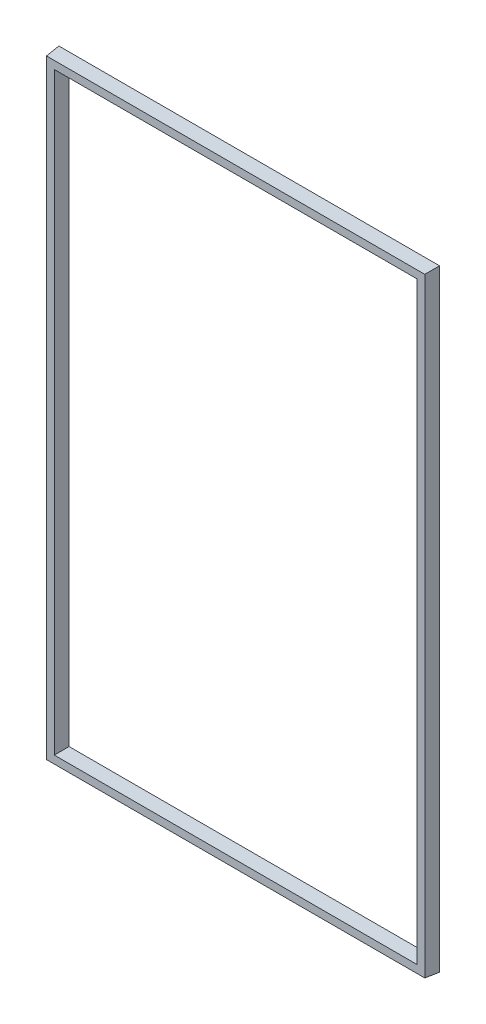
ISO-10303-21;
HEADER;
FILE_DESCRIPTION(('STEP AP214'),'2;1');
FILE_NAME('part.step','',(''),(''),'','','');
FILE_SCHEMA(('AUTOMOTIVE_DESIGN { 1 0 10303 214 1 1 1 1 }'));
ENDSEC;
DATA;
#1=APPLICATION_CONTEXT('core data for automotive mechanical design processes');
#2=APPLICATION_PROTOCOL_DEFINITION('international standard','automotive_design',2000,#1);
#3=PRODUCT_CONTEXT('',#1,'mechanical');
#4=PRODUCT('Part','Part','',(#3));
#5=PRODUCT_RELATED_PRODUCT_CATEGORY('part','',(#4));
#6=PRODUCT_DEFINITION_FORMATION('','',#4);
#7=PRODUCT_DEFINITION_CONTEXT('part definition',#1,'design');
#8=PRODUCT_DEFINITION('design','',#6,#7);
#9=PRODUCT_DEFINITION_SHAPE('','',#8);
#10=(LENGTH_UNIT() NAMED_UNIT(*) SI_UNIT(.MILLI.,.METRE.));
#11=(NAMED_UNIT(*) PLANE_ANGLE_UNIT() SI_UNIT($,.RADIAN.));
#12=(NAMED_UNIT(*) SI_UNIT($,.STERADIAN.) SOLID_ANGLE_UNIT());
#13=UNCERTAINTY_MEASURE_WITH_UNIT(LENGTH_MEASURE(1.E-05),#10,'distance_accuracy_value','');
#14=(GEOMETRIC_REPRESENTATION_CONTEXT(3) GLOBAL_UNCERTAINTY_ASSIGNED_CONTEXT((#13)) GLOBAL_UNIT_ASSIGNED_CONTEXT((#10,
#11,#12)) REPRESENTATION_CONTEXT('',''));
#15=CARTESIAN_POINT('',(0.,0.,0.));
#16=DIRECTION('',(0.,0.,1.));
#17=DIRECTION('',(1.,0.,0.));
#18=AXIS2_PLACEMENT_3D('',#15,#16,#17);
#19=CARTESIAN_POINT('',(0.,0.,2.));
#20=DIRECTION('',(0.,0.,1.));
#21=DIRECTION('',(1.,0.,0.));
#22=AXIS2_PLACEMENT_3D('',#19,#20,#21);
#23=PLANE('',#22);
#24=DIRECTION('',(-1.,0.,0.));
#25=VECTOR('',#24,1.);
#26=CARTESIAN_POINT('',(-63.,-97.3250226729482,2.));
#27=LINE('',#26,#25);
#28=CARTESIAN_POINT('',(-62.8250226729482,-97.3250226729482,2.));
#29=VERTEX_POINT('',#28);
#30=CARTESIAN_POINT('',(-7.17497732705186,-97.3250226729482,2.));
#31=VERTEX_POINT('',#30);
#32=EDGE_CURVE('E136',#29,#31,#27,.F.);
#33=ORIENTED_EDGE('',*,*,#32,.T.);
#34=DIRECTION('',(0.,-1.,0.));
#35=VECTOR('',#34,1.);
#36=CARTESIAN_POINT('',(-7.17497732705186,-12.,2.));
#37=LINE('',#36,#35);
#38=CARTESIAN_POINT('',(-7.17497732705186,-7.67497732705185,2.));
#39=VERTEX_POINT('',#38);
#40=EDGE_CURVE('E156',#31,#39,#37,.F.);
#41=ORIENTED_EDGE('',*,*,#40,.T.);
#42=DIRECTION('',(1.,0.,0.));
#43=VECTOR('',#42,1.);
#44=CARTESIAN_POINT('',(-7.00000000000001,-7.67497732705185,2.));
#45=LINE('',#44,#43);
#46=CARTESIAN_POINT('',(-62.8250226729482,-7.67497732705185,2.));
#47=VERTEX_POINT('',#46);
#48=EDGE_CURVE('E139',#39,#47,#45,.F.);
#49=ORIENTED_EDGE('',*,*,#48,.T.);
#50=DIRECTION('',(0.,1.,0.));
#51=VECTOR('',#50,1.);
#52=CARTESIAN_POINT('',(-62.8250226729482,-93.,2.));
#53=LINE('',#52,#51);
#54=EDGE_CURVE('E132',#47,#29,#53,.F.);
#55=ORIENTED_EDGE('',*,*,#54,.T.);
#56=EDGE_LOOP('',(#33,#41,#49,#55));
#57=FACE_BOUND('',#56,.T.);
#58=DIRECTION('',(-1.,0.,0.));
#59=VECTOR('',#58,1.);
#60=CARTESIAN_POINT('',(-8.50000000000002,-8.82502267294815,2.));
#61=LINE('',#60,#59);
#62=CARTESIAN_POINT('',(-8.32502267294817,-8.82502267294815,2.));
#63=VERTEX_POINT('',#62);
#64=CARTESIAN_POINT('',(-61.6749773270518,-8.82502267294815,2.));
#65=VERTEX_POINT('',#64);
#66=EDGE_CURVE('E51',#63,#65,#61,.T.);
#67=ORIENTED_EDGE('',*,*,#66,.F.);
#68=DIRECTION('',(0.,1.,0.));
#69=VECTOR('',#68,1.);
#70=CARTESIAN_POINT('',(-8.32502267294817,-96.,2.));
#71=LINE('',#70,#69);
#72=CARTESIAN_POINT('',(-8.32502267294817,-96.1749773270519,2.));
#73=VERTEX_POINT('',#72);
#74=EDGE_CURVE('E97',#73,#63,#71,.T.);
#75=ORIENTED_EDGE('',*,*,#74,.F.);
#76=DIRECTION('',(1.,0.,0.));
#77=VECTOR('',#76,1.);
#78=CARTESIAN_POINT('',(-61.5,-96.1749773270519,2.));
#79=LINE('',#78,#77);
#80=CARTESIAN_POINT('',(-61.6749773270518,-96.1749773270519,2.));
#81=VERTEX_POINT('',#80);
#82=EDGE_CURVE('E172',#81,#73,#79,.T.);
#83=ORIENTED_EDGE('',*,*,#82,.F.);
#84=DIRECTION('',(0.,-1.,0.));
#85=VECTOR('',#84,1.);
#86=CARTESIAN_POINT('',(-61.6749773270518,-9.,2.));
#87=LINE('',#86,#85);
#88=EDGE_CURVE('E185',#65,#81,#87,.T.);
#89=ORIENTED_EDGE('',*,*,#88,.F.);
#90=EDGE_LOOP('',(#67,#75,#83,#89));
#91=FACE_BOUND('',#90,.T.);
#92=ADVANCED_FACE('F47',(#57,#91),#23,.T.);
#93=CARTESIAN_POINT('',(0.,0.,0.));
#94=DIRECTION('',(0.,0.,1.));
#95=DIRECTION('',(1.,0.,0.));
#96=AXIS2_PLACEMENT_3D('',#93,#94,#95);
#97=PLANE('',#96);
#98=DIRECTION('',(1.,0.,0.));
#99=VECTOR('',#98,1.);
#100=CARTESIAN_POINT('',(-63.,-97.5,0.));
#101=LINE('',#100,#99);
#102=CARTESIAN_POINT('',(-63.,-97.5,0.));
#103=VERTEX_POINT('',#102);
#104=CARTESIAN_POINT('',(-7.00000000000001,-97.5,0.));
#105=VERTEX_POINT('',#104);
#106=EDGE_CURVE('E176',#103,#105,#101,.T.);
#107=ORIENTED_EDGE('',*,*,#106,.F.);
#108=DIRECTION('',(0.,-1.,0.));
#109=VECTOR('',#108,1.);
#110=CARTESIAN_POINT('',(-63.,-93.,0.));
#111=LINE('',#110,#109);
#112=CARTESIAN_POINT('',(-63.,-7.5,0.));
#113=VERTEX_POINT('',#112);
#114=EDGE_CURVE('E148',#113,#103,#111,.T.);
#115=ORIENTED_EDGE('',*,*,#114,.F.);
#116=DIRECTION('',(-1.,0.,0.));
#117=VECTOR('',#116,1.);
#118=CARTESIAN_POINT('',(-7.00000000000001,-7.5,0.));
#119=LINE('',#118,#117);
#120=CARTESIAN_POINT('',(-7.00000000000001,-7.5,0.));
#121=VERTEX_POINT('',#120);
#122=EDGE_CURVE('E162',#121,#113,#119,.T.);
#123=ORIENTED_EDGE('',*,*,#122,.F.);
#124=DIRECTION('',(0.,1.,0.));
#125=VECTOR('',#124,1.);
#126=CARTESIAN_POINT('',(-7.00000000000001,-12.,0.));
#127=LINE('',#126,#125);
#128=EDGE_CURVE('E202',#105,#121,#127,.T.);
#129=ORIENTED_EDGE('',*,*,#128,.F.);
#130=EDGE_LOOP('',(#107,#115,#123,#129));
#131=FACE_BOUND('',#130,.T.);
#132=DIRECTION('',(0.,1.,0.));
#133=VECTOR('',#132,1.);
#134=CARTESIAN_POINT('',(-8.50000000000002,-96.,0.));
#135=LINE('',#134,#133);
#136=CARTESIAN_POINT('',(-8.50000000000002,-96.,0.));
#137=VERTEX_POINT('',#136);
#138=CARTESIAN_POINT('',(-8.50000000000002,-9.,0.));
#139=VERTEX_POINT('',#138);
#140=EDGE_CURVE('E216',#137,#139,#135,.T.);
#141=ORIENTED_EDGE('',*,*,#140,.T.);
#142=DIRECTION('',(-1.,0.,0.));
#143=VECTOR('',#142,1.);
#144=CARTESIAN_POINT('',(-8.50000000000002,-9.,0.));
#145=LINE('',#144,#143);
#146=CARTESIAN_POINT('',(-61.5,-9.,0.));
#147=VERTEX_POINT('',#146);
#148=EDGE_CURVE('E213',#139,#147,#145,.T.);
#149=ORIENTED_EDGE('',*,*,#148,.T.);
#150=DIRECTION('',(0.,-1.,0.));
#151=VECTOR('',#150,1.);
#152=CARTESIAN_POINT('',(-61.5,-9.,0.));
#153=LINE('',#152,#151);
#154=CARTESIAN_POINT('',(-61.5,-96.,0.));
#155=VERTEX_POINT('',#154);
#156=EDGE_CURVE('E209',#147,#155,#153,.T.);
#157=ORIENTED_EDGE('',*,*,#156,.T.);
#158=DIRECTION('',(1.,0.,0.));
#159=VECTOR('',#158,1.);
#160=CARTESIAN_POINT('',(-61.5,-96.,0.));
#161=LINE('',#160,#159);
#162=EDGE_CURVE('E183',#155,#137,#161,.T.);
#163=ORIENTED_EDGE('',*,*,#162,.T.);
#164=EDGE_LOOP('',(#141,#149,#157,#163));
#165=FACE_BOUND('',#164,.T.);
#166=ADVANCED_FACE('F220',(#131,#165),#97,.F.);
#167=CARTESIAN_POINT('',(-63.,-97.5,0.));
#168=DIRECTION('',(0.,-0.996194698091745,0.0871557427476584));
#169=DIRECTION('',(0.,-0.0871557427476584,-0.996194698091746));
#170=AXIS2_PLACEMENT_3D('',#167,#168,#169);
#171=PLANE('',#170);
#172=ORIENTED_EDGE('',*,*,#106,.T.);
#173=DIRECTION('',(0.0868265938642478,-0.0868265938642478,-0.992432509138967));
#174=VECTOR('',#173,1.);
#175=CARTESIAN_POINT('',(-7.64457230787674,-96.8554276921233,7.3674951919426));
#176=LINE('',#175,#174);
#177=EDGE_CURVE('E11',#31,#105,#176,.T.);
#178=ORIENTED_EDGE('',*,*,#177,.F.);
#179=ORIENTED_EDGE('',*,*,#32,.F.);
#180=DIRECTION('',(-0.0868265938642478,-0.0868265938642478,-0.992432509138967));
#181=VECTOR('',#180,1.);
#182=CARTESIAN_POINT('',(-63.,-97.5,0.));
#183=LINE('',#182,#181);
#184=EDGE_CURVE('E144',#29,#103,#183,.T.);
#185=ORIENTED_EDGE('',*,*,#184,.T.);
#186=EDGE_LOOP('',(#172,#178,#179,#185));
#187=FACE_BOUND('',#186,.T.);
#188=ADVANCED_FACE('F154',(#187),#171,.T.);
#189=CARTESIAN_POINT('',(-7.00000000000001,-12.,0.));
#190=DIRECTION('',(0.996194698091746,0.,0.0871557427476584));
#191=DIRECTION('',(0.0871557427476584,0.,-0.996194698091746));
#192=AXIS2_PLACEMENT_3D('',#189,#190,#191);
#193=PLANE('',#192);
#194=ORIENTED_EDGE('',*,*,#128,.T.);
#195=DIRECTION('',(0.0868265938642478,0.0868265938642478,-0.992432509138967));
#196=VECTOR('',#195,1.);
#197=CARTESIAN_POINT('',(-7.00000000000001,-7.5,0.));
#198=LINE('',#197,#196);
#199=EDGE_CURVE('E58',#39,#121,#198,.T.);
#200=ORIENTED_EDGE('',*,*,#199,.F.);
#201=ORIENTED_EDGE('',*,*,#40,.F.);
#202=ORIENTED_EDGE('',*,*,#177,.T.);
#203=EDGE_LOOP('',(#194,#200,#201,#202));
#204=FACE_BOUND('',#203,.T.);
#205=ADVANCED_FACE('F234',(#204),#193,.T.);
#206=CARTESIAN_POINT('',(-7.00000000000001,-7.5,0.));
#207=DIRECTION('',(0.,0.996194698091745,0.0871557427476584));
#208=DIRECTION('',(0.,-0.0871557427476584,0.996194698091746));
#209=AXIS2_PLACEMENT_3D('',#206,#207,#208);
#210=PLANE('',#209);
#211=ORIENTED_EDGE('',*,*,#122,.T.);
#212=DIRECTION('',(-0.0868265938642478,0.0868265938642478,-0.992432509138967));
#213=VECTOR('',#212,1.);
#214=CARTESIAN_POINT('',(-62.3554276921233,-8.14457230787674,7.3674951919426));
#215=LINE('',#214,#213);
#216=EDGE_CURVE('E152',#47,#113,#215,.T.);
#217=ORIENTED_EDGE('',*,*,#216,.F.);
#218=ORIENTED_EDGE('',*,*,#48,.F.);
#219=ORIENTED_EDGE('',*,*,#199,.T.);
#220=EDGE_LOOP('',(#211,#217,#218,#219));
#221=FACE_BOUND('',#220,.T.);
#222=ADVANCED_FACE('F237',(#221),#210,.T.);
#223=CARTESIAN_POINT('',(-63.,-93.,0.));
#224=DIRECTION('',(-0.996194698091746,0.,0.0871557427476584));
#225=DIRECTION('',(0.0871557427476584,0.,0.996194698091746));
#226=AXIS2_PLACEMENT_3D('',#223,#224,#225);
#227=PLANE('',#226);
#228=ORIENTED_EDGE('',*,*,#114,.T.);
#229=ORIENTED_EDGE('',*,*,#184,.F.);
#230=ORIENTED_EDGE('',*,*,#54,.F.);
#231=ORIENTED_EDGE('',*,*,#216,.T.);
#232=EDGE_LOOP('',(#228,#229,#230,#231));
#233=FACE_BOUND('',#232,.T.);
#234=ADVANCED_FACE('F147',(#233),#227,.T.);
#235=CARTESIAN_POINT('',(-8.50000000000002,-96.,0.));
#236=DIRECTION('',(-0.996194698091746,0.,0.0871557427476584));
#237=DIRECTION('',(0.0871557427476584,0.,0.996194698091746));
#238=AXIS2_PLACEMENT_3D('',#235,#236,#237);
#239=PLANE('',#238);
#240=ORIENTED_EDGE('',*,*,#140,.F.);
#241=DIRECTION('',(-0.0868265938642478,0.0868265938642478,-0.992432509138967));
#242=VECTOR('',#241,1.);
#243=CARTESIAN_POINT('',(-8.50000000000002,-96.,0.));
#244=LINE('',#243,#242);
#245=EDGE_CURVE('E169',#73,#137,#244,.T.);
#246=ORIENTED_EDGE('',*,*,#245,.F.);
#247=ORIENTED_EDGE('',*,*,#74,.T.);
#248=DIRECTION('',(-0.0868265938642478,-0.0868265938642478,-0.992432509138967));
#249=VECTOR('',#248,1.);
#250=CARTESIAN_POINT('',(-8.50000000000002,-9.,0.));
#251=LINE('',#250,#249);
#252=EDGE_CURVE('E173',#63,#139,#251,.T.);
#253=ORIENTED_EDGE('',*,*,#252,.T.);
#254=EDGE_LOOP('',(#240,#246,#247,#253));
#255=FACE_BOUND('',#254,.T.);
#256=ADVANCED_FACE('F223',(#255),#239,.T.);
#257=CARTESIAN_POINT('',(-8.50000000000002,-9.,0.));
#258=DIRECTION('',(0.,-0.996194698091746,0.0871557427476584));
#259=DIRECTION('',(0.,-0.0871557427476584,-0.996194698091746));
#260=AXIS2_PLACEMENT_3D('',#257,#258,#259);
#261=PLANE('',#260);
#262=ORIENTED_EDGE('',*,*,#148,.F.);
#263=ORIENTED_EDGE('',*,*,#252,.F.);
#264=ORIENTED_EDGE('',*,*,#66,.T.);
#265=DIRECTION('',(0.0868265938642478,-0.0868265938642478,-0.992432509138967));
#266=VECTOR('',#265,1.);
#267=CARTESIAN_POINT('',(-61.5,-9.,0.));
#268=LINE('',#267,#266);
#269=EDGE_CURVE('E177',#65,#147,#268,.T.);
#270=ORIENTED_EDGE('',*,*,#269,.T.);
#271=EDGE_LOOP('',(#262,#263,#264,#270));
#272=FACE_BOUND('',#271,.T.);
#273=ADVANCED_FACE('F244',(#272),#261,.T.);
#274=CARTESIAN_POINT('',(-61.5,-9.,0.));
#275=DIRECTION('',(0.996194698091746,0.,0.0871557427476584));
#276=DIRECTION('',(0.0871557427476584,0.,-0.996194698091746));
#277=AXIS2_PLACEMENT_3D('',#274,#275,#276);
#278=PLANE('',#277);
#279=ORIENTED_EDGE('',*,*,#156,.F.);
#280=ORIENTED_EDGE('',*,*,#269,.F.);
#281=ORIENTED_EDGE('',*,*,#88,.T.);
#282=DIRECTION('',(0.0868265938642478,0.0868265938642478,-0.992432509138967));
#283=VECTOR('',#282,1.);
#284=CARTESIAN_POINT('',(-61.5,-96.,0.));
#285=LINE('',#284,#283);
#286=EDGE_CURVE('E67',#81,#155,#285,.T.);
#287=ORIENTED_EDGE('',*,*,#286,.T.);
#288=EDGE_LOOP('',(#279,#280,#281,#287));
#289=FACE_BOUND('',#288,.T.);
#290=ADVANCED_FACE('F246',(#289),#278,.T.);
#291=CARTESIAN_POINT('',(-61.5,-96.,0.));
#292=DIRECTION('',(0.,0.996194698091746,0.0871557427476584));
#293=DIRECTION('',(0.,-0.0871557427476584,0.996194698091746));
#294=AXIS2_PLACEMENT_3D('',#291,#292,#293);
#295=PLANE('',#294);
#296=ORIENTED_EDGE('',*,*,#162,.F.);
#297=ORIENTED_EDGE('',*,*,#286,.F.);
#298=ORIENTED_EDGE('',*,*,#82,.T.);
#299=ORIENTED_EDGE('',*,*,#245,.T.);
#300=EDGE_LOOP('',(#296,#297,#298,#299));
#301=FACE_BOUND('',#300,.T.);
#302=ADVANCED_FACE('F49',(#301),#295,.T.);
#303=CLOSED_SHELL('',(#92,#166,#188,#205,#222,#234,#256,#273,#290,#302));
#304=MANIFOLD_SOLID_BREP('B2',#303);
#305=ADVANCED_BREP_SHAPE_REPRESENTATION('',(#18,#304),#14);
#306=SHAPE_DEFINITION_REPRESENTATION(#9,#305);
ENDSEC;
END-ISO-10303-21;
